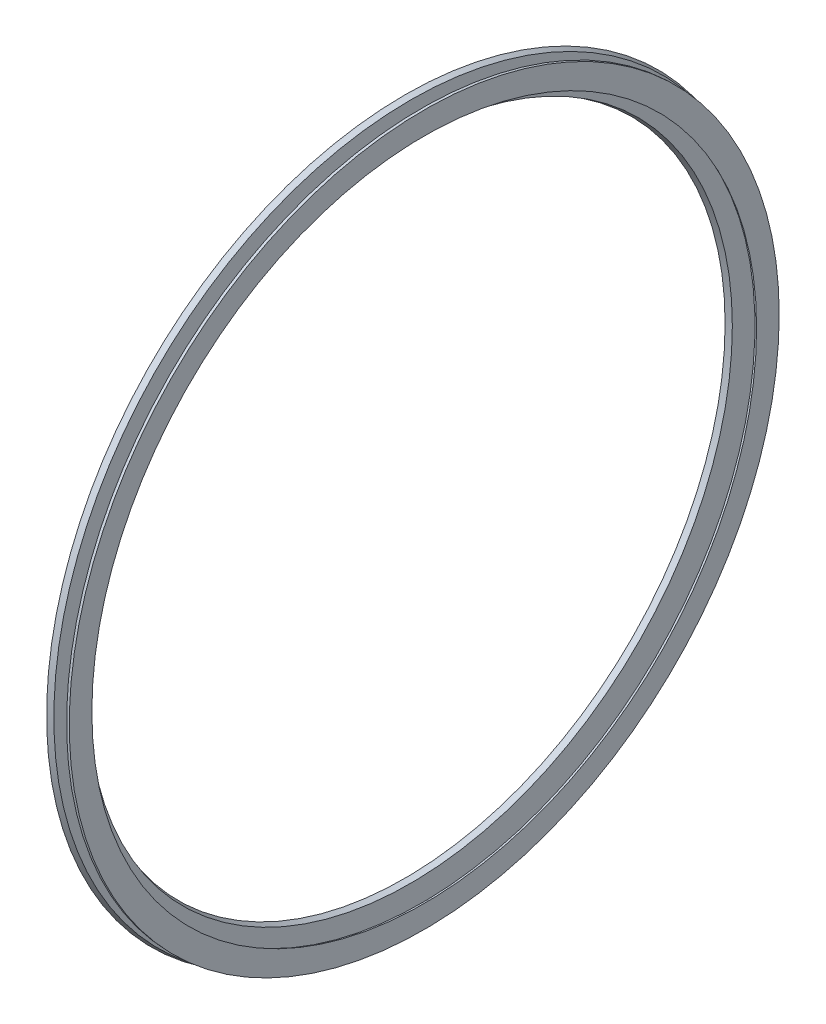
ISO-10303-21;
HEADER;
FILE_DESCRIPTION(('STEP AP214'),'2;1');
FILE_NAME('part.step','',(''),(''),'','','');
FILE_SCHEMA(('AUTOMOTIVE_DESIGN { 1 0 10303 214 1 1 1 1 }'));
ENDSEC;
DATA;
#1=APPLICATION_CONTEXT('core data for automotive mechanical design processes');
#2=APPLICATION_PROTOCOL_DEFINITION('international standard','automotive_design',2000,#1);
#3=PRODUCT_CONTEXT('',#1,'mechanical');
#4=PRODUCT('Part','Part','',(#3));
#5=PRODUCT_RELATED_PRODUCT_CATEGORY('part','',(#4));
#6=PRODUCT_DEFINITION_FORMATION('','',#4);
#7=PRODUCT_DEFINITION_CONTEXT('part definition',#1,'design');
#8=PRODUCT_DEFINITION('design','',#6,#7);
#9=PRODUCT_DEFINITION_SHAPE('','',#8);
#10=(LENGTH_UNIT() NAMED_UNIT(*) SI_UNIT(.MILLI.,.METRE.));
#11=(NAMED_UNIT(*) PLANE_ANGLE_UNIT() SI_UNIT($,.RADIAN.));
#12=(NAMED_UNIT(*) SI_UNIT($,.STERADIAN.) SOLID_ANGLE_UNIT());
#13=UNCERTAINTY_MEASURE_WITH_UNIT(LENGTH_MEASURE(1.E-05),#10,'distance_accuracy_value','');
#14=(GEOMETRIC_REPRESENTATION_CONTEXT(3) GLOBAL_UNCERTAINTY_ASSIGNED_CONTEXT((#13)) GLOBAL_UNIT_ASSIGNED_CONTEXT((#10,
#11,#12)) REPRESENTATION_CONTEXT('',''));
#15=CARTESIAN_POINT('',(0.,0.,0.));
#16=DIRECTION('',(0.,0.,1.));
#17=DIRECTION('',(1.,0.,0.));
#18=AXIS2_PLACEMENT_3D('',#15,#16,#17);
#19=CARTESIAN_POINT('',(-5.99375,0.,17.6508335));
#20=DIRECTION('',(-1.,0.,0.));
#21=DIRECTION('',(0.,0.,1.));
#22=AXIS2_PLACEMENT_3D('',#19,#20,#21);
#23=PLANE('',#22);
#24=CARTESIAN_POINT('',(-5.99375,0.,0.));
#25=DIRECTION('',(1.,0.,0.));
#26=DIRECTION('',(0.,0.,-1.));
#27=AXIS2_PLACEMENT_3D('',#24,#25,#26);
#28=CIRCLE('',#27,18.464587);
#29=CARTESIAN_POINT('',(-5.99375,0.,-18.464587));
#30=VERTEX_POINT('',#29);
#31=EDGE_CURVE('P0_E26',#30,#30,#28,.F.);
#32=ORIENTED_EDGE('',*,*,#31,.T.);
#33=EDGE_LOOP('',(#32));
#34=FACE_BOUND('',#33,.T.);
#35=CARTESIAN_POINT('',(-5.99375,0.,0.));
#36=DIRECTION('',(-1.,0.,0.));
#37=DIRECTION('',(0.,0.,1.));
#38=AXIS2_PLACEMENT_3D('',#35,#36,#37);
#39=CIRCLE('',#38,17.35225);
#40=CARTESIAN_POINT('',(-5.99375,0.,17.35225));
#41=VERTEX_POINT('',#40);
#42=EDGE_CURVE('P0_E17',#41,#41,#39,.F.);
#43=ORIENTED_EDGE('',*,*,#42,.T.);
#44=EDGE_LOOP('',(#43));
#45=FACE_BOUND('',#44,.T.);
#46=ADVANCED_FACE('P0_F13',(#34,#45),#23,.T.);
#47=CARTESIAN_POINT('',(-5.99375,0.,0.));
#48=DIRECTION('',(-1.,0.,0.));
#49=DIRECTION('',(0.,0.,1.));
#50=AXIS2_PLACEMENT_3D('',#47,#48,#49);
#51=CONICAL_SURFACE('',#50,17.35225,0.385103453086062);
#52=ORIENTED_EDGE('',*,*,#42,.F.);
#53=EDGE_LOOP('',(#52));
#54=FACE_BOUND('',#53,.T.);
#55=CARTESIAN_POINT('',(-5.85,0.,0.));
#56=DIRECTION('',(-1.,0.,0.));
#57=DIRECTION('',(0.,0.,1.));
#58=AXIS2_PLACEMENT_3D('',#55,#56,#57);
#59=CIRCLE('',#58,17.2939820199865);
#60=CARTESIAN_POINT('',(-5.85,0.,17.2939820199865));
#61=VERTEX_POINT('',#60);
#62=EDGE_CURVE('P0_E21',#61,#61,#59,.T.);
#63=ORIENTED_EDGE('',*,*,#62,.F.);
#64=EDGE_LOOP('',(#63));
#65=FACE_BOUND('',#64,.T.);
#66=ADVANCED_FACE('P0_F35',(#54,#65),#51,.F.);
#67=CARTESIAN_POINT('',(-5.99375000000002,0.,0.));
#68=DIRECTION('',(1.,0.,0.));
#69=DIRECTION('',(0.,0.,-1.));
#70=AXIS2_PLACEMENT_3D('',#67,#68,#69);
#71=CONICAL_SURFACE('',#70,18.464587,0.0425880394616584);
#72=ORIENTED_EDGE('',*,*,#31,.F.);
#73=EDGE_LOOP('',(#72));
#74=FACE_BOUND('',#73,.T.);
#75=CARTESIAN_POINT('',(-5.85,0.,0.));
#76=DIRECTION('',(1.,0.,0.));
#77=DIRECTION('',(0.,0.,-1.));
#78=AXIS2_PLACEMENT_3D('',#75,#76,#77);
#79=CIRCLE('',#78,18.4707127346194);
#80=CARTESIAN_POINT('',(-5.85,0.,-18.4707127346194));
#81=VERTEX_POINT('',#80);
#82=EDGE_CURVE('P0_E9',#81,#81,#79,.T.);
#83=ORIENTED_EDGE('',*,*,#82,.F.);
#84=EDGE_LOOP('',(#83));
#85=FACE_BOUND('',#84,.T.);
#86=ADVANCED_FACE('P0_F38',(#74,#85),#71,.T.);
#87=CARTESIAN_POINT('',(-5.85,0.,17.6508335));
#88=DIRECTION('',(1.,0.,0.));
#89=DIRECTION('',(0.,0.,-1.));
#90=AXIS2_PLACEMENT_3D('',#87,#88,#89);
#91=PLANE('',#90);
#92=ORIENTED_EDGE('',*,*,#82,.T.);
#93=EDGE_LOOP('',(#92));
#94=FACE_BOUND('',#93,.T.);
#95=ORIENTED_EDGE('',*,*,#62,.T.);
#96=EDGE_LOOP('',(#95));
#97=FACE_BOUND('',#96,.T.);
#98=ADVANCED_FACE('P0_F15',(#94,#97),#91,.T.);
#99=CLOSED_SHELL('',(#46,#66,#86,#98));
#100=MANIFOLD_SOLID_BREP('P0_B1',#99);
#101=CARTESIAN_POINT('',(-6.56875,0.,17.6508335));
#102=DIRECTION('',(1.,0.,0.));
#103=DIRECTION('',(0.,0.,-1.));
#104=AXIS2_PLACEMENT_3D('',#101,#102,#103);
#105=PLANE('',#104);
#106=CARTESIAN_POINT('',(-6.56875,0.,0.));
#107=DIRECTION('',(-1.,0.,0.));
#108=DIRECTION('',(0.,-1.,0.));
#109=AXIS2_PLACEMENT_3D('',#106,#107,#108);
#110=CIRCLE('',#109,18.5539202);
#111=CARTESIAN_POINT('',(-6.56875,-18.5539202,0.));
#112=VERTEX_POINT('',#111);
#113=EDGE_CURVE('P1_E26',#112,#112,#110,.F.);
#114=ORIENTED_EDGE('',*,*,#113,.T.);
#115=EDGE_LOOP('',(#114));
#116=FACE_BOUND('',#115,.T.);
#117=CARTESIAN_POINT('',(-6.56875,0.,0.));
#118=DIRECTION('',(1.,0.,0.));
#119=DIRECTION('',(0.,0.,-1.));
#120=AXIS2_PLACEMENT_3D('',#117,#118,#119);
#121=CIRCLE('',#120,16.75075);
#122=CARTESIAN_POINT('',(-6.56875,0.,-16.75075));
#123=VERTEX_POINT('',#122);
#124=EDGE_CURVE('P1_E17',#123,#123,#121,.F.);
#125=ORIENTED_EDGE('',*,*,#124,.T.);
#126=EDGE_LOOP('',(#125));
#127=FACE_BOUND('',#126,.T.);
#128=ADVANCED_FACE('P1_F13',(#116,#127),#105,.T.);
#129=CARTESIAN_POINT('',(-6.56875,0.,0.));
#130=DIRECTION('',(1.,0.,0.));
#131=DIRECTION('',(0.,0.,-1.));
#132=AXIS2_PLACEMENT_3D('',#129,#130,#131);
#133=CONICAL_SURFACE('',#132,16.75075,0.301266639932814);
#134=ORIENTED_EDGE('',*,*,#124,.F.);
#135=EDGE_LOOP('',(#134));
#136=FACE_BOUND('',#135,.T.);
#137=CARTESIAN_POINT('',(-6.85625,0.,0.));
#138=DIRECTION('',(1.,0.,0.));
#139=DIRECTION('',(0.,0.,-1.));
#140=AXIS2_PLACEMENT_3D('',#137,#138,#139);
#141=CIRCLE('',#140,16.6614166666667);
#142=CARTESIAN_POINT('',(-6.85625,0.,-16.6614166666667));
#143=VERTEX_POINT('',#142);
#144=EDGE_CURVE('P1_E21',#143,#143,#141,.T.);
#145=ORIENTED_EDGE('',*,*,#144,.F.);
#146=EDGE_LOOP('',(#145));
#147=FACE_BOUND('',#146,.T.);
#148=ADVANCED_FACE('P1_F35',(#136,#147),#133,.F.);
#149=CARTESIAN_POINT('',(-6.56875,0.,0.));
#150=DIRECTION('',(-1.,0.,0.));
#151=DIRECTION('',(0.,-1.,0.));
#152=AXIS2_PLACEMENT_3D('',#149,#150,#151);
#153=CONICAL_SURFACE('',#152,18.5539202,0.301266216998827);
#154=ORIENTED_EDGE('',*,*,#113,.F.);
#155=EDGE_LOOP('',(#154));
#156=FACE_BOUND('',#155,.T.);
#157=CARTESIAN_POINT('',(-6.85625,0.,0.));
#158=DIRECTION('',(-1.,0.,0.));
#159=DIRECTION('',(0.,-1.,0.));
#160=AXIS2_PLACEMENT_3D('',#157,#158,#159);
#161=CIRCLE('',#160,18.6432534);
#162=CARTESIAN_POINT('',(-6.85625,-18.6432534,0.));
#163=VERTEX_POINT('',#162);
#164=EDGE_CURVE('P1_E9',#163,#163,#161,.T.);
#165=ORIENTED_EDGE('',*,*,#164,.F.);
#166=EDGE_LOOP('',(#165));
#167=FACE_BOUND('',#166,.T.);
#168=ADVANCED_FACE('P1_F38',(#156,#167),#153,.T.);
#169=CARTESIAN_POINT('',(-6.85625,0.,17.6508335));
#170=DIRECTION('',(-1.,0.,0.));
#171=DIRECTION('',(0.,0.,1.));
#172=AXIS2_PLACEMENT_3D('',#169,#170,#171);
#173=PLANE('',#172);
#174=ORIENTED_EDGE('',*,*,#164,.T.);
#175=EDGE_LOOP('',(#174));
#176=FACE_BOUND('',#175,.T.);
#177=ORIENTED_EDGE('',*,*,#144,.T.);
#178=EDGE_LOOP('',(#177));
#179=FACE_BOUND('',#178,.T.);
#180=ADVANCED_FACE('P1_F15',(#176,#179),#173,.T.);
#181=CLOSED_SHELL('',(#128,#148,#168,#180));
#182=MANIFOLD_SOLID_BREP('P1_B1',#181);
#183=ADVANCED_BREP_SHAPE_REPRESENTATION('',(#18,#100,#182),#14);
#184=SHAPE_DEFINITION_REPRESENTATION(#9,#183);
ENDSEC;
END-ISO-10303-21;
